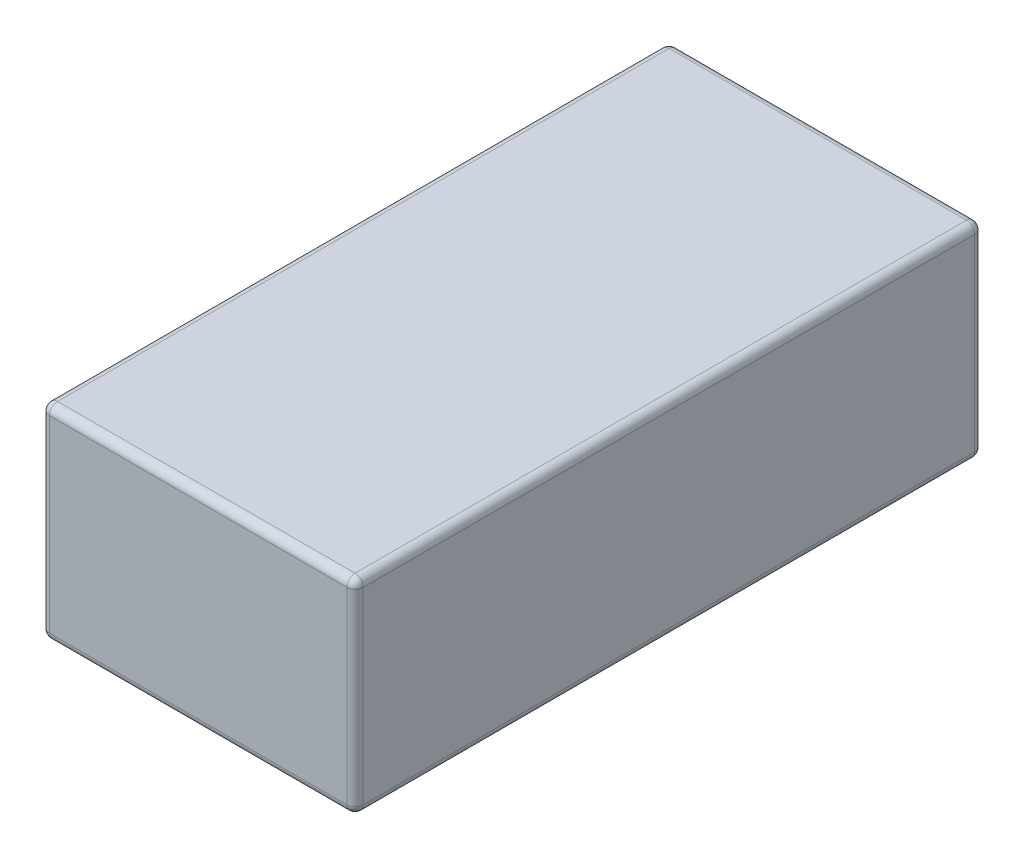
from build123d import *

# Parameters (mm, degrees)
SKETCH1_W           = 115
SKETCH1_H           = 75
BOSS_EXTRUDE1_DEPTH = 115
FILLET1_R           = 3


with BuildPart() as part:
    # Sketch1 → Boss-Extrude1 (new, symmetric)
    with BuildSketch(Plane.XY):
        Rectangle(SKETCH1_W, SKETCH1_H)
    extrude(amount=BOSS_EXTRUDE1_DEPTH, both=True)

    # Fillet1
    fillet1_edges = [part.edges().sort_by_distance(p)[0] for p in [
        (-57.5, 0, 115),
        (0, -37.5, 115),
        (57.5, 0, 115),
        (0, -37.5, -115),
        (-57.5, 0, -115),
        (0, 37.5, -115),
        (57.5, 0, -115),
        (57.5, -37.5, 0),
        (-57.5, -37.5, 0),
        (-57.5, 37.5, 0),
        (57.5, 37.5, 0),
        (0, 37.5, 115),
    ]]
    fillet(fillet1_edges, radius=FILLET1_R)


solid = part.part
